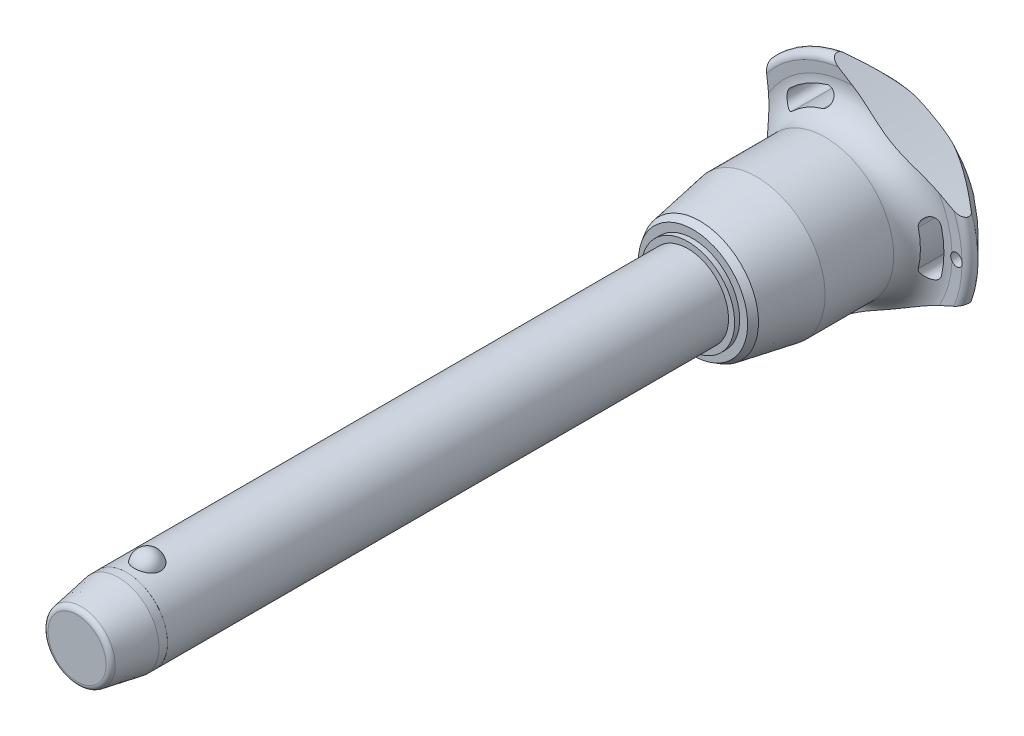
from build123d import *

# Parameters (mm, degrees)
SKETCH1_R           = 10
BOSS_EXTRUDE1_DEPTH = 130
SKETCH2_R           = 8.75
BOSS_EXTRUDE2_DEPTH = 50.7
BOSS_EXTRUDE3_START = 20.5
SKETCH1_2_R         = 10
BOSS_EXTRUDE3_DEPTH = 20.5
CHAMFER1_SIZE       = 10.25
CHAMFER1_SIZE2      = 1.807351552
FILLET1_R           = 1.25
SKETCH6_R           = 176.92625
CUT_EXTRUDE1_DEPTH  = 186.156340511
CIRPATTERN1_COUNT   = 3
SKETCH7_R           = 1.5
CUT_EXTRUDE2_DEPTH  = 186.074106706
SKETCH8_R           = 10
SKETCH8_R_2         = 9.99
CUT_EXTRUDE3_DEPTH  = 12.3


with BuildPart() as part:
    # Sketch1 → Boss-Extrude1 (new body)
    with BuildSketch(Plane.XY):
        Circle(SKETCH1_R)
    extrude(amount=-BOSS_EXTRUDE1_DEPTH)

    # Sketch2 → Boss-Extrude2 (add)
    with BuildSketch(Plane(origin=(0, 0, -130), x_dir=(-1, 0, 0), z_dir=(0, 0, -1))):
        with Locations(Location((0, 0, 0), (0, 0, 180))):
            Circle(SKETCH2_R)
    extrude(amount=BOSS_EXTRUDE2_DEPTH)

    # Sketch3 → Revolve1 (revolve)
    with BuildSketch(Plane(origin=(0, 0, 0), x_dir=(0, 0, -1), z_dir=(1, 0, 0))):
        with BuildLine():
            Line((-3.201562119, 12.5), (-3.201562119, 5.9))
            ThreePointArc((-3.201562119, 5.9), (0.098437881, 9.2), (-3.201562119, 12.5))
        make_face()
        with BuildLine():
            Line((-3.201562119, -5.9), (-3.201562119, -12.5))
            ThreePointArc((-3.201562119, -12.5), (0.098437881, -9.2), (-3.201562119, -5.9))
        make_face()
    revolve(axis=Axis((0, -5.9, 3.201562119), (0, 1, 0)))

    # Sketch1_2 → Boss-Extrude3 (add)
    with BuildSketch(Plane.XY.offset(BOSS_EXTRUDE3_START)):
        Circle(SKETCH1_2_R)
    extrude(amount=-BOSS_EXTRUDE3_DEPTH)

    # Chamfer1
    chamfer1_edges = [part.edges().sort_by_distance(p)[0] for p in [
        (-10, 0, 20.5),
    ]]
    chamfer1_side = [part.faces().sort_by_distance(p)[0] for p in [
        (-10, 0, -54.75),
    ]]
    chamfer(chamfer1_edges, length=CHAMFER1_SIZE, length2=CHAMFER1_SIZE2, reference=chamfer1_side[0])

    # Fillet1
    fillet1_edges = [part.edges().sort_by_distance(p)[0] for p in [
        (-8.192648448, 0, 20.5),
        (-8.75, 0, -180.7),
    ]]
    fillet(fillet1_edges, radius=FILLET1_R)

    # Sketch4 → Revolve2 (revolve)
    with BuildSketch(Plane(origin=(0, 0, 0), x_dir=(0, 0, -1), z_dir=(1, 0, 0)), mode=Mode.PRIVATE) as revolve2_sk:
        Polygon((130, 0), (130, 11.504815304), (131.25, 11.504815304), (131.25, 13.461079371), (132.944174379, 14.439211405), (146.9, 16.9), (163.8, 16.9), (163.8, 0), align=None)
    revolve(revolve2_sk.sketch.rotate(Axis((0, 0, -163.8), (0, 0, 1)), 90), axis=Axis((0, 0, -163.8), (0, 0, 1)))

    # Sketch5 → Revolve3 (revolve)
    with BuildSketch(Plane(origin=(0, 0, 0), x_dir=(0, 0, -1), z_dir=(1, 0, 0)), mode=Mode.PRIVATE) as revolve3_sk:
        with BuildLine():
            Line((170.790129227, 24.271609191), (170.652256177, 26.865060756))
            ThreePointArc((170.652256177, 26.865060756), (171.598671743, 28.411427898), (173.38137085, 28.08137085))
            Line((173.38137085, 28.08137085), (179.763226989, 21.69951471))
            ThreePointArc((179.763226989, 21.69951471), (180.7, 19.381044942), (179.683055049, 17.096604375))
            ThreePointArc((179.683055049, 17.096604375), (174.18864484, 9.321268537), (172.25, 0))
            Line((172.25, 0), (163.8, 0))
            Line((163.8, 0), (163.8, 16.9))
            ThreePointArc((163.8, 16.9), (168.879432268, 19.083427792), (170.790129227, 24.271609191))
        make_face()
    revolve(revolve3_sk.sketch.rotate(Axis((0, 0, -172.25), (0, 0, 1)), 90), axis=Axis((0, 0, -172.25), (0, 0, 1)))

    # Sketch6 → Cut-Extrude1 (cut, through all)
    with BuildSketch(Plane.XY):
        with Locations((-197.42625, 0)):
            Circle(SKETCH6_R)
        with BuildLine():
            ThreePointArc((21.802992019, -5.260839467), (22.428706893, 0), (21.802992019, 5.260839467))
            ThreePointArc((21.802992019, 5.260839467), (19.579234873, 6.620060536), (18.220013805, 4.39630339))
            ThreePointArc((18.220013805, 4.39630339), (18.742902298, 0), (18.220013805, -4.39630339))
            ThreePointArc((18.220013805, -4.39630339), (19.579234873, -6.620060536), (21.802992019, -5.260839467))
        make_face()
    cut_extrude1 = extrude(amount=-CUT_EXTRUDE1_DEPTH, mode=Mode.SUBTRACT)

    # CirPattern1: Cut-Extrude1 ×3 about axis
    cirpattern1_axis = Axis((0, 0, 0), (0, 0, 1))
    for i in range(1, CIRPATTERN1_COUNT):
        add(cut_extrude1.rotate(cirpattern1_axis, i * 360 / CIRPATTERN1_COUNT), mode=Mode.SUBTRACT)

    # Sketch7 → Cut-Extrude2 (cut, through all)
    with BuildSketch(Plane.XY):
        with Locations(Location((25.428706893, 0, 0), (0, 0, 17.230769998))):
            Circle(SKETCH7_R)
    extrude(amount=-CUT_EXTRUDE2_DEPTH, mode=Mode.SUBTRACT)

    # Sketch8 → Cut-Extrude3 (cut)
    with BuildSketch(Plane.XY.offset(20.5)):
        Circle(SKETCH8_R)
        Circle(SKETCH8_R_2, mode=Mode.SUBTRACT)
    extrude(amount=-CUT_EXTRUDE3_DEPTH, mode=Mode.SUBTRACT)


solid = part.part
